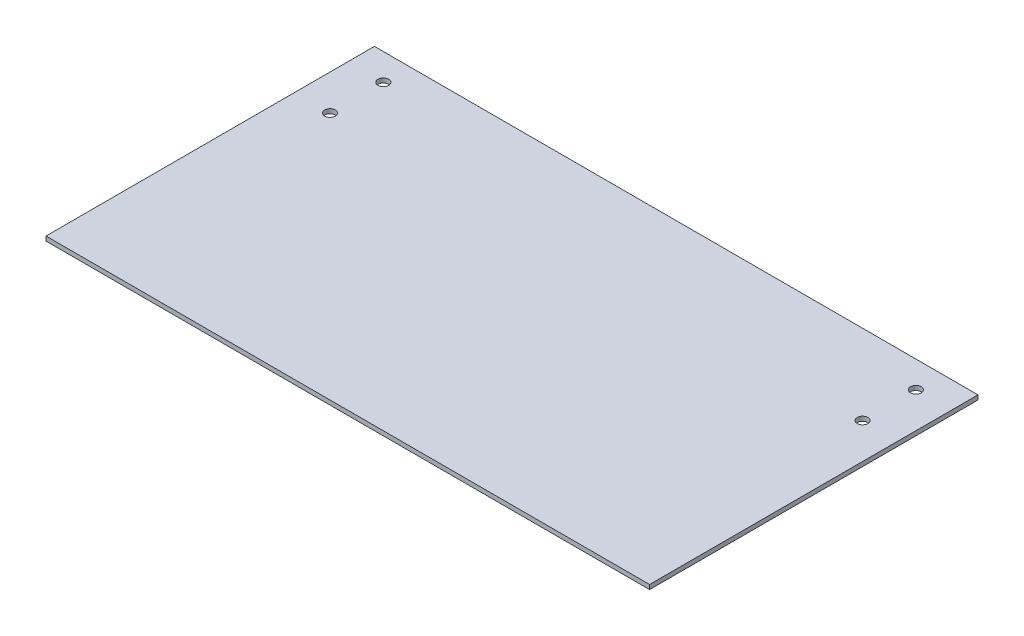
ISO-10303-21;
HEADER;
FILE_DESCRIPTION(('STEP AP214'),'2;1');
FILE_NAME('part.step','',(''),(''),'','','');
FILE_SCHEMA(('AUTOMOTIVE_DESIGN { 1 0 10303 214 1 1 1 1 }'));
ENDSEC;
DATA;
#1=APPLICATION_CONTEXT('core data for automotive mechanical design processes');
#2=APPLICATION_PROTOCOL_DEFINITION('international standard','automotive_design',2000,#1);
#3=PRODUCT_CONTEXT('',#1,'mechanical');
#4=PRODUCT('Part','Part','',(#3));
#5=PRODUCT_RELATED_PRODUCT_CATEGORY('part','',(#4));
#6=PRODUCT_DEFINITION_FORMATION('','',#4);
#7=PRODUCT_DEFINITION_CONTEXT('part definition',#1,'design');
#8=PRODUCT_DEFINITION('design','',#6,#7);
#9=PRODUCT_DEFINITION_SHAPE('','',#8);
#10=(LENGTH_UNIT() NAMED_UNIT(*) SI_UNIT(.MILLI.,.METRE.));
#11=(NAMED_UNIT(*) PLANE_ANGLE_UNIT() SI_UNIT($,.RADIAN.));
#12=(NAMED_UNIT(*) SI_UNIT($,.STERADIAN.) SOLID_ANGLE_UNIT());
#13=UNCERTAINTY_MEASURE_WITH_UNIT(LENGTH_MEASURE(1.E-05),#10,'distance_accuracy_value','');
#14=(GEOMETRIC_REPRESENTATION_CONTEXT(3) GLOBAL_UNCERTAINTY_ASSIGNED_CONTEXT((#13)) GLOBAL_UNIT_ASSIGNED_CONTEXT((#10,
#11,#12)) REPRESENTATION_CONTEXT('',''));
#15=CARTESIAN_POINT('',(0.,0.,0.));
#16=DIRECTION('',(0.,0.,1.));
#17=DIRECTION('',(1.,0.,0.));
#18=AXIS2_PLACEMENT_3D('',#15,#16,#17);
#19=CARTESIAN_POINT('',(-170.,2.5,92.5));
#20=DIRECTION('',(1.,0.,0.));
#21=DIRECTION('',(0.,0.,-1.));
#22=AXIS2_PLACEMENT_3D('',#19,#20,#21);
#23=PLANE('',#22);
#24=DIRECTION('',(0.,0.,1.));
#25=VECTOR('',#24,1.);
#26=CARTESIAN_POINT('',(-170.,0.,92.5));
#27=LINE('',#26,#25);
#28=CARTESIAN_POINT('',(-170.,0.,-92.5));
#29=VERTEX_POINT('',#28);
#30=CARTESIAN_POINT('',(-170.,0.,92.5));
#31=VERTEX_POINT('',#30);
#32=EDGE_CURVE('E99',#29,#31,#27,.T.);
#33=ORIENTED_EDGE('',*,*,#32,.T.);
#34=DIRECTION('',(0.,-1.,0.));
#35=VECTOR('',#34,1.);
#36=CARTESIAN_POINT('',(-170.,2.5,92.5));
#37=LINE('',#36,#35);
#38=CARTESIAN_POINT('',(-170.,2.5,92.5));
#39=VERTEX_POINT('',#38);
#40=EDGE_CURVE('E11',#39,#31,#37,.T.);
#41=ORIENTED_EDGE('',*,*,#40,.F.);
#42=DIRECTION('',(0.,0.,1.));
#43=VECTOR('',#42,1.);
#44=CARTESIAN_POINT('',(-170.,2.5,92.5));
#45=LINE('',#44,#43);
#46=CARTESIAN_POINT('',(-170.,2.5,-92.5));
#47=VERTEX_POINT('',#46);
#48=EDGE_CURVE('E87',#47,#39,#45,.T.);
#49=ORIENTED_EDGE('',*,*,#48,.F.);
#50=DIRECTION('',(0.,-1.,0.));
#51=VECTOR('',#50,1.);
#52=CARTESIAN_POINT('',(-170.,2.5,-92.5));
#53=LINE('',#52,#51);
#54=EDGE_CURVE('E95',#47,#29,#53,.T.);
#55=ORIENTED_EDGE('',*,*,#54,.T.);
#56=EDGE_LOOP('',(#33,#41,#49,#55));
#57=FACE_BOUND('',#56,.T.);
#58=ADVANCED_FACE('F36',(#57),#23,.F.);
#59=CARTESIAN_POINT('',(170.,2.5,92.5));
#60=DIRECTION('',(0.,0.,-1.));
#61=DIRECTION('',(-1.,0.,0.));
#62=AXIS2_PLACEMENT_3D('',#59,#60,#61);
#63=PLANE('',#62);
#64=DIRECTION('',(1.,0.,0.));
#65=VECTOR('',#64,1.);
#66=CARTESIAN_POINT('',(170.,0.,92.5));
#67=LINE('',#66,#65);
#68=CARTESIAN_POINT('',(170.,0.,92.5));
#69=VERTEX_POINT('',#68);
#70=EDGE_CURVE('E91',#31,#69,#67,.T.);
#71=ORIENTED_EDGE('',*,*,#70,.T.);
#72=DIRECTION('',(0.,-1.,0.));
#73=VECTOR('',#72,1.);
#74=CARTESIAN_POINT('',(170.,2.5,92.5));
#75=LINE('',#74,#73);
#76=CARTESIAN_POINT('',(170.,2.5,92.5));
#77=VERTEX_POINT('',#76);
#78=EDGE_CURVE('E44',#77,#69,#75,.T.);
#79=ORIENTED_EDGE('',*,*,#78,.F.);
#80=DIRECTION('',(1.,0.,0.));
#81=VECTOR('',#80,1.);
#82=CARTESIAN_POINT('',(170.,2.5,92.5));
#83=LINE('',#82,#81);
#84=EDGE_CURVE('E82',#39,#77,#83,.T.);
#85=ORIENTED_EDGE('',*,*,#84,.F.);
#86=ORIENTED_EDGE('',*,*,#40,.T.);
#87=EDGE_LOOP('',(#71,#79,#85,#86));
#88=FACE_BOUND('',#87,.T.);
#89=ADVANCED_FACE('F90',(#88),#63,.F.);
#90=CARTESIAN_POINT('',(170.,2.5,92.5));
#91=DIRECTION('',(-1.,0.,0.));
#92=DIRECTION('',(0.,0.,1.));
#93=AXIS2_PLACEMENT_3D('',#90,#91,#92);
#94=PLANE('',#93);
#95=DIRECTION('',(0.,0.,-1.));
#96=VECTOR('',#95,1.);
#97=CARTESIAN_POINT('',(170.,0.,92.5));
#98=LINE('',#97,#96);
#99=CARTESIAN_POINT('',(170.,0.,-92.5));
#100=VERTEX_POINT('',#99);
#101=EDGE_CURVE('E69',#69,#100,#98,.T.);
#102=ORIENTED_EDGE('',*,*,#101,.T.);
#103=DIRECTION('',(0.,-1.,0.));
#104=VECTOR('',#103,1.);
#105=CARTESIAN_POINT('',(170.,2.5,-92.5));
#106=LINE('',#105,#104);
#107=CARTESIAN_POINT('',(170.,2.5,-92.5));
#108=VERTEX_POINT('',#107);
#109=EDGE_CURVE('E92',#108,#100,#106,.T.);
#110=ORIENTED_EDGE('',*,*,#109,.F.);
#111=DIRECTION('',(0.,0.,-1.));
#112=VECTOR('',#111,1.);
#113=CARTESIAN_POINT('',(170.,2.5,92.5));
#114=LINE('',#113,#112);
#115=EDGE_CURVE('E85',#77,#108,#114,.T.);
#116=ORIENTED_EDGE('',*,*,#115,.F.);
#117=ORIENTED_EDGE('',*,*,#78,.T.);
#118=EDGE_LOOP('',(#102,#110,#116,#117));
#119=FACE_BOUND('',#118,.T.);
#120=ADVANCED_FACE('F93',(#119),#94,.F.);
#121=CARTESIAN_POINT('',(170.,2.5,-92.5));
#122=DIRECTION('',(0.,0.,1.));
#123=DIRECTION('',(1.,0.,0.));
#124=AXIS2_PLACEMENT_3D('',#121,#122,#123);
#125=PLANE('',#124);
#126=DIRECTION('',(-1.,0.,0.));
#127=VECTOR('',#126,1.);
#128=CARTESIAN_POINT('',(170.,0.,-92.5));
#129=LINE('',#128,#127);
#130=EDGE_CURVE('E75',#100,#29,#129,.T.);
#131=ORIENTED_EDGE('',*,*,#130,.T.);
#132=ORIENTED_EDGE('',*,*,#54,.F.);
#133=DIRECTION('',(-1.,0.,0.));
#134=VECTOR('',#133,1.);
#135=CARTESIAN_POINT('',(170.,2.5,-92.5));
#136=LINE('',#135,#134);
#137=EDGE_CURVE('E52',#108,#47,#136,.T.);
#138=ORIENTED_EDGE('',*,*,#137,.F.);
#139=ORIENTED_EDGE('',*,*,#109,.T.);
#140=EDGE_LOOP('',(#131,#132,#138,#139));
#141=FACE_BOUND('',#140,.T.);
#142=ADVANCED_FACE('F107',(#141),#125,.F.);
#143=CARTESIAN_POINT('',(0.,2.5,0.));
#144=DIRECTION('',(0.,1.,0.));
#145=DIRECTION('',(0.,0.,1.));
#146=AXIS2_PLACEMENT_3D('',#143,#144,#145);
#147=PLANE('',#146);
#148=CARTESIAN_POINT('',(-150.,2.5,-47.5));
#149=DIRECTION('',(0.,1.,0.));
#150=DIRECTION('',(0.,0.,1.));
#151=AXIS2_PLACEMENT_3D('',#148,#149,#150);
#152=CIRCLE('',#151,2.99999999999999);
#153=CARTESIAN_POINT('',(-150.,2.5,-44.5));
#154=VERTEX_POINT('',#153);
#155=EDGE_CURVE('E126',#154,#154,#152,.T.);
#156=ORIENTED_EDGE('',*,*,#155,.F.);
#157=EDGE_LOOP('',(#156));
#158=FACE_BOUND('',#157,.T.);
#159=CARTESIAN_POINT('',(150.,2.5,-77.5));
#160=DIRECTION('',(0.,1.,0.));
#161=DIRECTION('',(0.,0.,1.));
#162=AXIS2_PLACEMENT_3D('',#159,#160,#161);
#163=CIRCLE('',#162,2.99999999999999);
#164=CARTESIAN_POINT('',(150.,2.5,-74.5));
#165=VERTEX_POINT('',#164);
#166=EDGE_CURVE('E119',#165,#165,#163,.T.);
#167=ORIENTED_EDGE('',*,*,#166,.F.);
#168=EDGE_LOOP('',(#167));
#169=FACE_BOUND('',#168,.T.);
#170=CARTESIAN_POINT('',(150.,2.5,-47.5));
#171=DIRECTION('',(0.,1.,0.));
#172=DIRECTION('',(0.,0.,1.));
#173=AXIS2_PLACEMENT_3D('',#170,#171,#172);
#174=CIRCLE('',#173,2.99999999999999);
#175=CARTESIAN_POINT('',(150.,2.5,-44.5));
#176=VERTEX_POINT('',#175);
#177=EDGE_CURVE('E131',#176,#176,#174,.T.);
#178=ORIENTED_EDGE('',*,*,#177,.F.);
#179=EDGE_LOOP('',(#178));
#180=FACE_BOUND('',#179,.T.);
#181=CARTESIAN_POINT('',(-150.,2.5,-77.5));
#182=DIRECTION('',(0.,1.,0.));
#183=DIRECTION('',(0.,0.,1.));
#184=AXIS2_PLACEMENT_3D('',#181,#182,#183);
#185=CIRCLE('',#184,2.99999999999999);
#186=CARTESIAN_POINT('',(-150.,2.5,-74.5));
#187=VERTEX_POINT('',#186);
#188=EDGE_CURVE('E113',#187,#187,#185,.T.);
#189=ORIENTED_EDGE('',*,*,#188,.F.);
#190=EDGE_LOOP('',(#189));
#191=FACE_BOUND('',#190,.T.);
#192=ORIENTED_EDGE('',*,*,#48,.T.);
#193=ORIENTED_EDGE('',*,*,#84,.T.);
#194=ORIENTED_EDGE('',*,*,#115,.T.);
#195=ORIENTED_EDGE('',*,*,#137,.T.);
#196=EDGE_LOOP('',(#192,#193,#194,#195));
#197=FACE_BOUND('',#196,.T.);
#198=ADVANCED_FACE('F83',(#158,#169,#180,#191,#197),#147,.T.);
#199=CARTESIAN_POINT('',(0.,0.,0.));
#200=DIRECTION('',(0.,1.,0.));
#201=DIRECTION('',(0.,0.,1.));
#202=AXIS2_PLACEMENT_3D('',#199,#200,#201);
#203=PLANE('',#202);
#204=CARTESIAN_POINT('',(-150.,0.,-47.5));
#205=DIRECTION('',(0.,1.,0.));
#206=DIRECTION('',(0.,0.,1.));
#207=AXIS2_PLACEMENT_3D('',#204,#205,#206);
#208=CIRCLE('',#207,2.99999999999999);
#209=CARTESIAN_POINT('',(-150.,0.,-44.5));
#210=VERTEX_POINT('',#209);
#211=EDGE_CURVE('E116',#210,#210,#208,.T.);
#212=ORIENTED_EDGE('',*,*,#211,.T.);
#213=EDGE_LOOP('',(#212));
#214=FACE_BOUND('',#213,.T.);
#215=CARTESIAN_POINT('',(150.,0.,-77.5));
#216=DIRECTION('',(0.,1.,0.));
#217=DIRECTION('',(0.,0.,1.));
#218=AXIS2_PLACEMENT_3D('',#215,#216,#217);
#219=CIRCLE('',#218,2.99999999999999);
#220=CARTESIAN_POINT('',(150.,0.,-74.5));
#221=VERTEX_POINT('',#220);
#222=EDGE_CURVE('E122',#221,#221,#219,.T.);
#223=ORIENTED_EDGE('',*,*,#222,.T.);
#224=EDGE_LOOP('',(#223));
#225=FACE_BOUND('',#224,.T.);
#226=CARTESIAN_POINT('',(150.,0.,-47.5));
#227=DIRECTION('',(0.,1.,0.));
#228=DIRECTION('',(0.,0.,1.));
#229=AXIS2_PLACEMENT_3D('',#226,#227,#228);
#230=CIRCLE('',#229,2.99999999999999);
#231=CARTESIAN_POINT('',(150.,0.,-44.5));
#232=VERTEX_POINT('',#231);
#233=EDGE_CURVE('E123',#232,#232,#230,.T.);
#234=ORIENTED_EDGE('',*,*,#233,.T.);
#235=EDGE_LOOP('',(#234));
#236=FACE_BOUND('',#235,.T.);
#237=CARTESIAN_POINT('',(-150.,0.,-77.5));
#238=DIRECTION('',(0.,1.,0.));
#239=DIRECTION('',(0.,0.,1.));
#240=AXIS2_PLACEMENT_3D('',#237,#238,#239);
#241=CIRCLE('',#240,2.99999999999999);
#242=CARTESIAN_POINT('',(-150.,0.,-74.5));
#243=VERTEX_POINT('',#242);
#244=EDGE_CURVE('E102',#243,#243,#241,.T.);
#245=ORIENTED_EDGE('',*,*,#244,.T.);
#246=EDGE_LOOP('',(#245));
#247=FACE_BOUND('',#246,.T.);
#248=ORIENTED_EDGE('',*,*,#32,.F.);
#249=ORIENTED_EDGE('',*,*,#130,.F.);
#250=ORIENTED_EDGE('',*,*,#101,.F.);
#251=ORIENTED_EDGE('',*,*,#70,.F.);
#252=EDGE_LOOP('',(#248,#249,#250,#251));
#253=FACE_BOUND('',#252,.T.);
#254=ADVANCED_FACE('F110',(#214,#225,#236,#247,#253),#203,.F.);
#255=CARTESIAN_POINT('',(-150.,0.,-77.5));
#256=DIRECTION('',(0.,1.,0.));
#257=DIRECTION('',(0.,0.,1.));
#258=AXIS2_PLACEMENT_3D('',#255,#256,#257);
#259=CYLINDRICAL_SURFACE('',#258,2.99999999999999);
#260=ORIENTED_EDGE('',*,*,#244,.F.);
#261=EDGE_LOOP('',(#260));
#262=FACE_BOUND('',#261,.T.);
#263=ORIENTED_EDGE('',*,*,#188,.T.);
#264=EDGE_LOOP('',(#263));
#265=FACE_BOUND('',#264,.T.);
#266=ADVANCED_FACE('F143',(#262,#265),#259,.F.);
#267=CARTESIAN_POINT('',(150.,0.,-47.5));
#268=DIRECTION('',(0.,1.,0.));
#269=DIRECTION('',(0.,0.,1.));
#270=AXIS2_PLACEMENT_3D('',#267,#268,#269);
#271=CYLINDRICAL_SURFACE('',#270,2.99999999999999);
#272=ORIENTED_EDGE('',*,*,#233,.F.);
#273=EDGE_LOOP('',(#272));
#274=FACE_BOUND('',#273,.T.);
#275=ORIENTED_EDGE('',*,*,#177,.T.);
#276=EDGE_LOOP('',(#275));
#277=FACE_BOUND('',#276,.T.);
#278=ADVANCED_FACE('F139',(#274,#277),#271,.F.);
#279=CARTESIAN_POINT('',(150.,0.,-77.5));
#280=DIRECTION('',(0.,1.,0.));
#281=DIRECTION('',(0.,0.,1.));
#282=AXIS2_PLACEMENT_3D('',#279,#280,#281);
#283=CYLINDRICAL_SURFACE('',#282,2.99999999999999);
#284=ORIENTED_EDGE('',*,*,#222,.F.);
#285=EDGE_LOOP('',(#284));
#286=FACE_BOUND('',#285,.T.);
#287=ORIENTED_EDGE('',*,*,#166,.T.);
#288=EDGE_LOOP('',(#287));
#289=FACE_BOUND('',#288,.T.);
#290=ADVANCED_FACE('F142',(#286,#289),#283,.F.);
#291=CARTESIAN_POINT('',(-150.,0.,-47.5));
#292=DIRECTION('',(0.,1.,0.));
#293=DIRECTION('',(0.,0.,1.));
#294=AXIS2_PLACEMENT_3D('',#291,#292,#293);
#295=CYLINDRICAL_SURFACE('',#294,2.99999999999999);
#296=ORIENTED_EDGE('',*,*,#211,.F.);
#297=EDGE_LOOP('',(#296));
#298=FACE_BOUND('',#297,.T.);
#299=ORIENTED_EDGE('',*,*,#155,.T.);
#300=EDGE_LOOP('',(#299));
#301=FACE_BOUND('',#300,.T.);
#302=ADVANCED_FACE('F204',(#298,#301),#295,.F.);
#303=CLOSED_SHELL('',(#58,#89,#120,#142,#198,#254,#266,#278,#290,#302));
#304=MANIFOLD_SOLID_BREP('B2',#303);
#305=ADVANCED_BREP_SHAPE_REPRESENTATION('',(#18,#304),#14);
#306=SHAPE_DEFINITION_REPRESENTATION(#9,#305);
ENDSEC;
END-ISO-10303-21;
